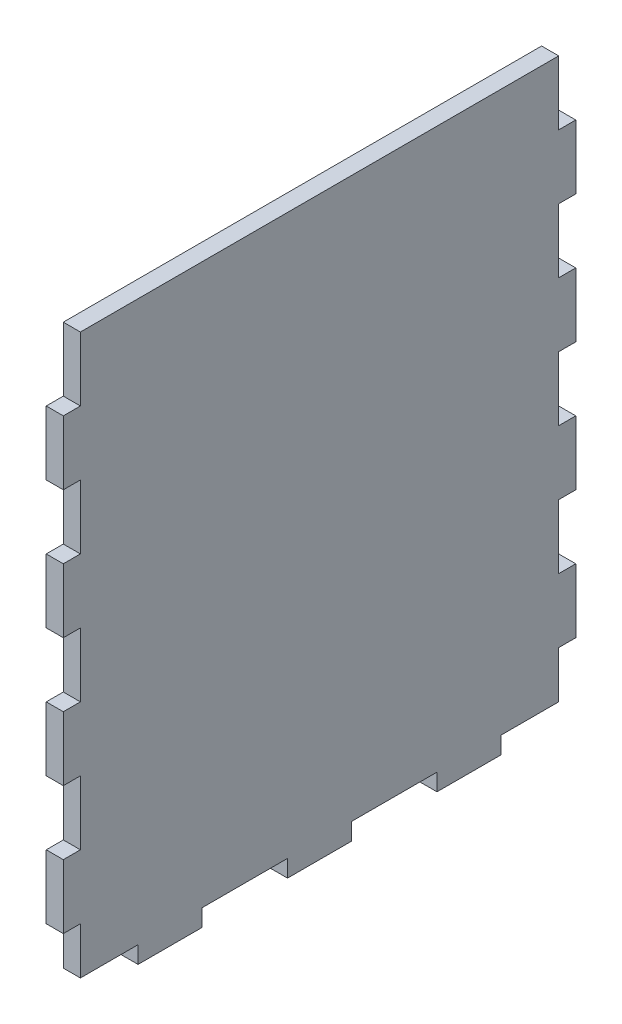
from build123d import *

# Parameters (mm, degrees)
SKETCH1_W               = 120
SKETCH1_H               = 135
BOSS_EXTRUDE1_DEPTH     = 4
CUT_EXTRUDE1_DEPTH      = 181.668204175
CUT_EXTRUDE1_DEPTH_BACK = 181.668204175
SKETCH1_3_W             = 17.5
SKETCH1_3_H             = 4
SKETCH1_3_W_2           = 20
SKETCH2_W               = 4
SKETCH2_H               = 15
CUT_EXTRUDE2_DEPTH      = 181.668204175


with BuildPart() as part:
    # Sketch1 → Boss-Extrude1 (new body)
    with BuildSketch(Plane(origin=(0, 0, 0), x_dir=(0, 0, -1), z_dir=(1, 0, 0))):
        with Locations((60, 67.5)):
            Rectangle(SKETCH1_W, SKETCH1_H)
    extrude(amount=BOSS_EXTRUDE1_DEPTH)

    # Sketch1_3 → Cut-Extrude1 (cut, two sides: drawn at the far end of the back side and taken through both)
    with BuildSketch(Plane(origin=(0, 0, 0), x_dir=(0, 0, -1), z_dir=(1, 0, 0)).offset(-CUT_EXTRUDE1_DEPTH_BACK)):
        with Locations((8.75, 2)):
            Rectangle(SKETCH1_3_W, SKETCH1_3_H)
        with Locations((42.5, 2)):
            Rectangle(SKETCH1_3_W_2, SKETCH1_3_H)
        with Locations((77.5, 2)):
            Rectangle(SKETCH1_3_W_2, SKETCH1_3_H)
        with Locations((111.25, 2)):
            Rectangle(SKETCH1_3_W, SKETCH1_3_H)
    extrude(amount=CUT_EXTRUDE1_DEPTH + CUT_EXTRUDE1_DEPTH_BACK, mode=Mode.SUBTRACT)

    # Sketch2 → Cut-Extrude2 (cut, symmetric)
    with BuildSketch(Plane(origin=(4, 0, 0), x_dir=(0, 0, -1), z_dir=(1, 0, 0))):
        with Locations((2, 97.5)):
            Rectangle(SKETCH2_W, SKETCH2_H)
        with Locations((2, 7.5)):
            Rectangle(SKETCH2_W, SKETCH2_H)
        with Locations((2, 37.5)):
            Rectangle(SKETCH2_W, SKETCH2_H)
        with Locations((2, 67.5)):
            Rectangle(SKETCH2_W, SKETCH2_H)
        with Locations((2, 127.5)):
            Rectangle(SKETCH2_W, SKETCH2_H)
    cut_extrude2 = extrude(amount=CUT_EXTRUDE2_DEPTH, both=True, mode=Mode.SUBTRACT)

    # Mirror1: Cut-Extrude2 across plane
    add(cut_extrude2.mirror(Plane.XY.offset(-60)), mode=Mode.SUBTRACT)


solid = part.part
